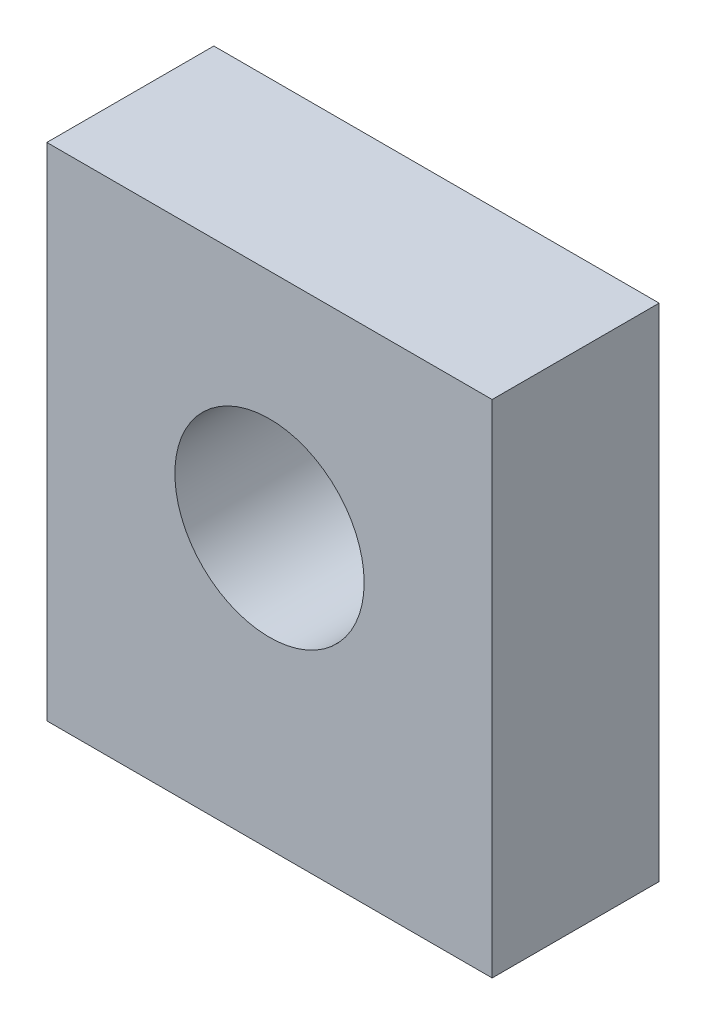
from build123d import *

# Parameters (mm, degrees)
SKETCH_1_W              = 8
SKETCH_1_H              = 9
SKETCH_1_R              = 1.7
CLIP_M3_CLEARANCE_DEPTH = 3


with BuildPart() as part:
    # Sketch 1 → Clip_M3_clearance (new body)
    with BuildSketch(Plane.XY):
        with Locations((0, -0.5)):
            Rectangle(SKETCH_1_W, SKETCH_1_H)
        Circle(SKETCH_1_R, mode=Mode.SUBTRACT)
    extrude(amount=CLIP_M3_CLEARANCE_DEPTH)


solid = part.part
